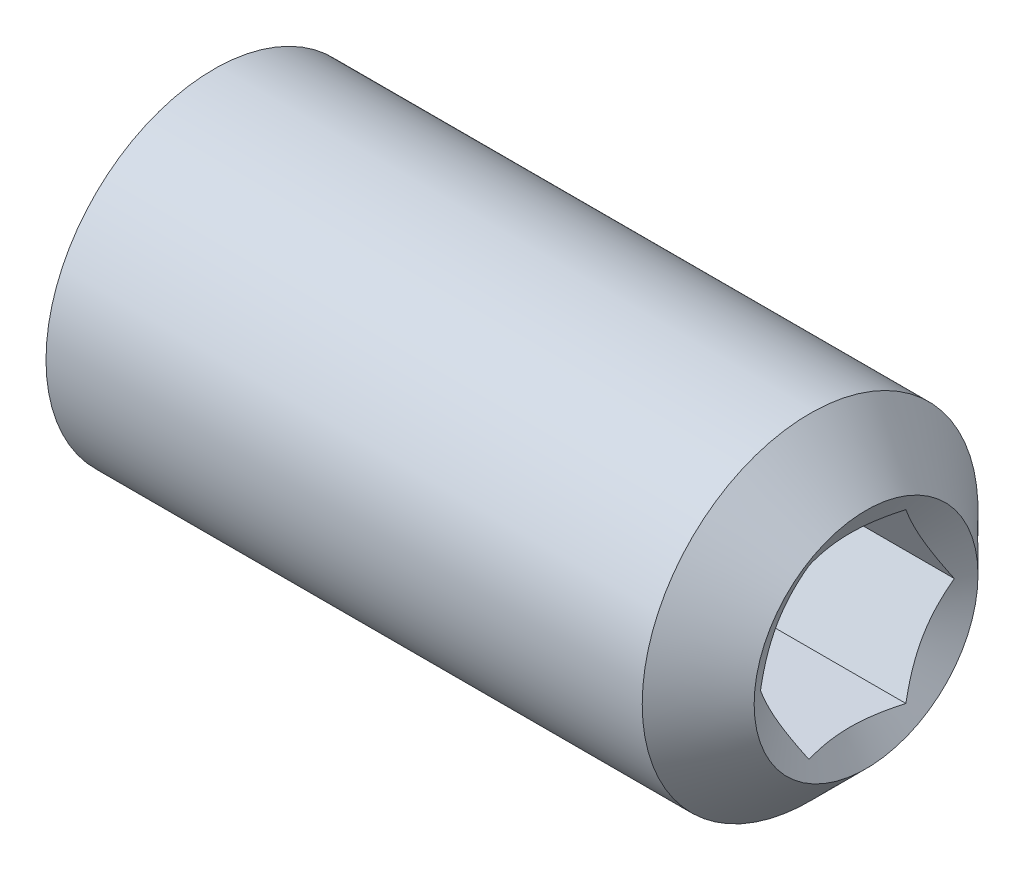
ISO-10303-21;
HEADER;
FILE_DESCRIPTION(('STEP AP214'),'2;1');
FILE_NAME('part.step','',(''),(''),'','','');
FILE_SCHEMA(('AUTOMOTIVE_DESIGN { 1 0 10303 214 1 1 1 1 }'));
ENDSEC;
DATA;
#1=APPLICATION_CONTEXT('core data for automotive mechanical design processes');
#2=APPLICATION_PROTOCOL_DEFINITION('international standard','automotive_design',2000,#1);
#3=PRODUCT_CONTEXT('',#1,'mechanical');
#4=PRODUCT('Part','Part','',(#3));
#5=PRODUCT_RELATED_PRODUCT_CATEGORY('part','',(#4));
#6=PRODUCT_DEFINITION_FORMATION('','',#4);
#7=PRODUCT_DEFINITION_CONTEXT('part definition',#1,'design');
#8=PRODUCT_DEFINITION('design','',#6,#7);
#9=PRODUCT_DEFINITION_SHAPE('','',#8);
#10=(LENGTH_UNIT() NAMED_UNIT(*) SI_UNIT(.MILLI.,.METRE.));
#11=(NAMED_UNIT(*) PLANE_ANGLE_UNIT() SI_UNIT($,.RADIAN.));
#12=(NAMED_UNIT(*) SI_UNIT($,.STERADIAN.) SOLID_ANGLE_UNIT());
#13=UNCERTAINTY_MEASURE_WITH_UNIT(LENGTH_MEASURE(1.E-05),#10,'distance_accuracy_value','');
#14=(GEOMETRIC_REPRESENTATION_CONTEXT(3) GLOBAL_UNCERTAINTY_ASSIGNED_CONTEXT((#13)) GLOBAL_UNIT_ASSIGNED_CONTEXT((#10,
#11,#12)) REPRESENTATION_CONTEXT('',''));
#15=CARTESIAN_POINT('',(0.,0.,0.));
#16=DIRECTION('',(0.,0.,1.));
#17=DIRECTION('',(1.,0.,0.));
#18=AXIS2_PLACEMENT_3D('',#15,#16,#17);
#19=CARTESIAN_POINT('',(0.,0.,0.));
#20=DIRECTION('',(-1.,0.,0.));
#21=DIRECTION('',(0.,0.,1.));
#22=AXIS2_PLACEMENT_3D('',#19,#20,#21);
#23=PLANE('',#22);
#24=CARTESIAN_POINT('',(0.,0.,0.));
#25=DIRECTION('',(-1.,0.,0.));
#26=DIRECTION('',(0.,0.,1.));
#27=AXIS2_PLACEMENT_3D('',#24,#25,#26);
#28=CIRCLE('',#27,2.4);
#29=CARTESIAN_POINT('',(0.,0.,2.4));
#30=VERTEX_POINT('',#29);
#31=EDGE_CURVE('E135',#30,#30,#28,.T.);
#32=ORIENTED_EDGE('',*,*,#31,.T.);
#33=EDGE_LOOP('',(#32));
#34=FACE_BOUND('',#33,.T.);
#35=DIRECTION('',(0.,0.,-1.));
#36=VECTOR('',#35,1.);
#37=CARTESIAN_POINT('',(0.,1.5,0.866025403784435));
#38=LINE('',#37,#36);
#39=CARTESIAN_POINT('',(0.,1.5,0.866025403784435));
#40=VERTEX_POINT('',#39);
#41=CARTESIAN_POINT('',(0.,1.5,-0.866025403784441));
#42=VERTEX_POINT('',#41);
#43=EDGE_CURVE('E108',#40,#42,#38,.T.);
#44=ORIENTED_EDGE('',*,*,#43,.F.);
#45=DIRECTION('',(0.,-0.866025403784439,0.5));
#46=VECTOR('',#45,1.);
#47=CARTESIAN_POINT('',(0.,1.5,0.866025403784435));
#48=LINE('',#47,#46);
#49=CARTESIAN_POINT('',(0.,0.,1.73205080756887));
#50=VERTEX_POINT('',#49);
#51=EDGE_CURVE('E52',#40,#50,#48,.T.);
#52=ORIENTED_EDGE('',*,*,#51,.T.);
#53=DIRECTION('',(0.,0.866025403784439,0.5));
#54=VECTOR('',#53,1.);
#55=CARTESIAN_POINT('',(0.,-1.5,0.866025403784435));
#56=LINE('',#55,#54);
#57=CARTESIAN_POINT('',(0.,-1.5,0.866025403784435));
#58=VERTEX_POINT('',#57);
#59=EDGE_CURVE('E98',#58,#50,#56,.T.);
#60=ORIENTED_EDGE('',*,*,#59,.F.);
#61=DIRECTION('',(0.,0.,-1.));
#62=VECTOR('',#61,1.);
#63=CARTESIAN_POINT('',(0.,-1.5,0.866025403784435));
#64=LINE('',#63,#62);
#65=CARTESIAN_POINT('',(0.,-1.5,-0.866025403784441));
#66=VERTEX_POINT('',#65);
#67=EDGE_CURVE('E104',#58,#66,#64,.T.);
#68=ORIENTED_EDGE('',*,*,#67,.T.);
#69=DIRECTION('',(0.,0.866025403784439,-0.5));
#70=VECTOR('',#69,1.);
#71=CARTESIAN_POINT('',(0.,-1.5,-0.866025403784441));
#72=LINE('',#71,#70);
#73=CARTESIAN_POINT('',(0.,0.,-1.73205080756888));
#74=VERTEX_POINT('',#73);
#75=EDGE_CURVE('E112',#66,#74,#72,.T.);
#76=ORIENTED_EDGE('',*,*,#75,.T.);
#77=DIRECTION('',(0.,-0.866025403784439,-0.5));
#78=VECTOR('',#77,1.);
#79=CARTESIAN_POINT('',(0.,1.5,-0.866025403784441));
#80=LINE('',#79,#78);
#81=EDGE_CURVE('E115',#42,#74,#80,.T.);
#82=ORIENTED_EDGE('',*,*,#81,.F.);
#83=EDGE_LOOP('',(#44,#52,#60,#68,#76,#82));
#84=FACE_BOUND('',#83,.T.);
#85=ADVANCED_FACE('F33',(#34,#84),#23,.T.);
#86=CARTESIAN_POINT('',(10.8452994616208,0.,0.));
#87=DIRECTION('',(1.,0.,0.));
#88=DIRECTION('',(0.,0.,-1.));
#89=AXIS2_PLACEMENT_3D('',#86,#87,#88);
#90=CONICAL_SURFACE('',#89,0.,1.0471975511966);
#91=CARTESIAN_POINT('',(12.,0.,0.));
#92=DIRECTION('',(-1.,0.,0.));
#93=DIRECTION('',(0.,0.,1.));
#94=AXIS2_PLACEMENT_3D('',#91,#92,#93);
#95=CIRCLE('',#94,2.);
#96=CARTESIAN_POINT('',(12.,0.,2.));
#97=VERTEX_POINT('',#96);
#98=EDGE_CURVE('E94',#97,#97,#95,.T.);
#99=ORIENTED_EDGE('',*,*,#98,.F.);
#100=EDGE_LOOP('',(#99));
#101=FACE_BOUND('',#100,.T.);
#102=CARTESIAN_POINT('',(11.8453661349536,1.5002,0.865909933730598));
#103=CARTESIAN_POINT('',(11.8233823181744,1.43428070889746,0.903968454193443));
#104=CARTESIAN_POINT('',(11.803388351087,1.36779241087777,0.942355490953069));
#105=CARTESIAN_POINT('',(11.7684875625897,1.23366433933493,1.01979436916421));
#106=CARTESIAN_POINT('',(11.7535930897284,1.16602218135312,1.05884758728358));
#107=CARTESIAN_POINT('',(11.7304061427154,1.03157622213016,1.13646999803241));
#108=CARTESIAN_POINT('',(11.721959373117,0.964793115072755,1.17502724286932));
#109=CARTESIAN_POINT('',(11.711873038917,0.830912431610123,1.25232329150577));
#110=CARTESIAN_POINT('',(11.7102251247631,0.763815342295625,1.29106181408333));
#111=CARTESIAN_POINT('',(11.7136410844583,0.638425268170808,1.363455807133));
#112=CARTESIAN_POINT('',(11.7178662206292,0.580113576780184,1.39712207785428));
#113=CARTESIAN_POINT('',(11.7312612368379,0.463870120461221,1.46423526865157));
#114=CARTESIAN_POINT('',(11.740435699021,0.405938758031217,1.49768195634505));
#115=CARTESIAN_POINT('',(11.7633726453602,0.289455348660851,1.56493368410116));
#116=CARTESIAN_POINT('',(11.7772324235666,0.230918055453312,1.59873020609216));
#117=CARTESIAN_POINT('',(11.8086892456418,0.114716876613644,1.6658189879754));
#118=CARTESIAN_POINT('',(11.8262788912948,0.0570515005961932,1.69911210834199));
#119=CARTESIAN_POINT('',(11.8453661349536,-0.000199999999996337,1.73216627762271));
#120=B_SPLINE_CURVE_WITH_KNOTS('',3,(#102,#103,#104,#105,#106,#107,#108,#109,#110,#111,#112,
#113,#114,#115,#116,#117,#118,#119),.UNSPECIFIED.,.F.,.F.,(4,2,2,2,2,2,2,2,4),(0.,
0.237777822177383,0.476127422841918,0.70857706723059,0.94074115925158,1.1429435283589,
1.34533342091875,1.55221450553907,1.75868901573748),.UNSPECIFIED.);
#121=CARTESIAN_POINT('',(11.8452994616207,1.5,0.866025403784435));
#122=VERTEX_POINT('',#121);
#123=CARTESIAN_POINT('',(11.8452994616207,0.,1.73205080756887));
#124=VERTEX_POINT('',#123);
#125=EDGE_CURVE('E11',#122,#124,#120,.T.);
#126=ORIENTED_EDGE('',*,*,#125,.F.);
#127=CARTESIAN_POINT('',(12.4201683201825,1.5,-2.27829668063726));
#128=CARTESIAN_POINT('',(12.3887590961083,1.5,-2.21314327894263));
#129=CARTESIAN_POINT('',(12.3576654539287,1.5,-2.14783511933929));
#130=CARTESIAN_POINT('',(12.2962877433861,1.5,-2.01682641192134));
#131=CARTESIAN_POINT('',(12.2660038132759,1.5,-1.95112579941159));
#132=CARTESIAN_POINT('',(12.2062612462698,1.5,-1.81888739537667));
#133=CARTESIAN_POINT('',(12.1768084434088,1.5,-1.75234695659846));
#134=CARTESIAN_POINT('',(12.1191756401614,1.5,-1.61872045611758));
#135=CARTESIAN_POINT('',(12.0909955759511,1.5,-1.55163442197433));
#136=CARTESIAN_POINT('',(12.0354632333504,1.5,-1.41488579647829));
#137=CARTESIAN_POINT('',(12.0081572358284,1.5,-1.34520416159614));
#138=CARTESIAN_POINT('',(11.955740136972,1.5,-1.20502279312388));
#139=CARTESIAN_POINT('',(11.9306293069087,1.5,-1.13452295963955));
#140=CARTESIAN_POINT('',(11.8596091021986,1.5,-0.921892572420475));
#141=CARTESIAN_POINT('',(11.8178535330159,1.5,-0.778257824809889));
#142=CARTESIAN_POINT('',(11.7689246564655,1.5,-0.560067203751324));
#143=CARTESIAN_POINT('',(11.7549158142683,1.5,-0.487052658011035));
#144=CARTESIAN_POINT('',(11.7323734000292,1.5,-0.340164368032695));
#145=CARTESIAN_POINT('',(11.7238393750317,1.5,-0.266290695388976));
#146=CARTESIAN_POINT('',(11.7130363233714,1.5,-0.118999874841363));
#147=CARTESIAN_POINT('',(11.7106905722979,1.5,-0.0455885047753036));
#148=CARTESIAN_POINT('',(11.7122563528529,1.5,0.101165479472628));
#149=CARTESIAN_POINT('',(11.71616820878,1.5,0.17450808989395));
#150=CARTESIAN_POINT('',(11.7329926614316,1.5,0.353360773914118));
#151=CARTESIAN_POINT('',(11.7491516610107,1.5,0.458566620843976));
#152=CARTESIAN_POINT('',(11.7913869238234,1.5,0.666968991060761));
#153=CARTESIAN_POINT('',(11.8174732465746,1.5,0.770163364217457));
#154=CARTESIAN_POINT('',(11.8774371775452,1.5,0.976776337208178));
#155=CARTESIAN_POINT('',(11.9114795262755,1.5,1.08014595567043));
#156=CARTESIAN_POINT('',(11.9663975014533,1.5,1.23376876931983));
#157=CARTESIAN_POINT('',(11.9853433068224,1.5,1.28473152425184));
#158=CARTESIAN_POINT('',(12.0243145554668,1.5,1.38624265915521));
#159=CARTESIAN_POINT('',(12.0443399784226,1.5,1.43679104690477));
#160=CARTESIAN_POINT('',(12.098134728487,1.5,1.56913564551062));
#161=CARTESIAN_POINT('',(12.132641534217,1.5,1.65063135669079));
#162=CARTESIAN_POINT('',(12.2034369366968,1.5,1.81284754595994));
#163=CARTESIAN_POINT('',(12.239725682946,1.5,1.89356795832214));
#164=CARTESIAN_POINT('',(12.3506237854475,1.5,2.13484537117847));
#165=CARTESIAN_POINT('',(12.4272466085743,1.5,2.2944747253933));
#166=CARTESIAN_POINT('',(12.5838318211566,1.5,2.61233200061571));
#167=CARTESIAN_POINT('',(12.6637985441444,1.5,2.77055775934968));
#168=CARTESIAN_POINT('',(12.8258358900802,1.5,3.08589273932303));
#169=CARTESIAN_POINT('',(12.9079061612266,1.5,3.24300214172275));
#170=CARTESIAN_POINT('',(13.0652617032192,1.5,3.54089305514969));
#171=CARTESIAN_POINT('',(13.1404113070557,1.5,3.6817464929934));
#172=CARTESIAN_POINT('',(13.2915707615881,1.5,3.96299957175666));
#173=CARTESIAN_POINT('',(13.3675806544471,1.5,4.10339918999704));
#174=CARTESIAN_POINT('',(13.5200274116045,1.5,4.38345606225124));
#175=CARTESIAN_POINT('',(13.5964624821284,1.5,4.52311429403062));
#176=CARTESIAN_POINT('',(13.7498269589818,1.5,4.80214740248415));
#177=CARTESIAN_POINT('',(13.82675633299,1.5,4.94152229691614));
#178=CARTESIAN_POINT('',(13.9038663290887,1.5,5.08079657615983));
#179=B_SPLINE_CURVE_WITH_KNOTS('',3,(#127,#128,#129,#130,#131,#132,#133,#134,#135,#136,#137,
#138,#139,#140,#141,#142,#143,#144,#145,#146,#147,#148,#149,#150,#151,#152,#153,#154,#155,#156,
#157,#158,#159,#160,#161,#162,#163,#164,#165,#166,#167,#168,#169,#170,#171,#172,#173,#174,#175,
#176,#177,#178),.UNSPECIFIED.,.F.,.F.,(4,2,2,2,2,2,2,2,2,2,2,2,2,2,2,2,2,2,2,2,2,2,2,2,2,4),(0.,
0.216990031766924,0.434016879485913,0.652307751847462,0.870587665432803,1.09507057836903,
1.3195811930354,1.76738754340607,1.9902617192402,2.21311745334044,2.43319686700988,
2.65328768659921,2.97194700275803,3.29093008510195,3.61721788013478,3.780321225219,
3.94342150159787,4.20889133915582,4.47438348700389,5.00551027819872,5.53734811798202,
6.06909758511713,6.54803514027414,7.02699627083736,7.50461499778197,7.98220280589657),.UNSPECIFIED.);
#180=CARTESIAN_POINT('',(11.8452994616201,1.5,-0.866025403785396));
#181=VERTEX_POINT('',#180);
#182=EDGE_CURVE('E138',#122,#181,#179,.F.);
#183=ORIENTED_EDGE('',*,*,#182,.T.);
#184=CARTESIAN_POINT('',(11.8453661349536,1.5002,-0.865909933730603));
#185=CARTESIAN_POINT('',(11.8233823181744,1.43428070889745,-0.903968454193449));
#186=CARTESIAN_POINT('',(11.803388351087,1.36779241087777,-0.942355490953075));
#187=CARTESIAN_POINT('',(11.7684875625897,1.23366433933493,-1.01979436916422));
#188=CARTESIAN_POINT('',(11.7535930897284,1.16602218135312,-1.05884758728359));
#189=CARTESIAN_POINT('',(11.7304061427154,1.03157622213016,-1.13646999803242));
#190=CARTESIAN_POINT('',(11.721959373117,0.964793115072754,-1.17502724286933));
#191=CARTESIAN_POINT('',(11.711873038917,0.830912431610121,-1.25232329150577));
#192=CARTESIAN_POINT('',(11.7102251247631,0.763815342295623,-1.29106181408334));
#193=CARTESIAN_POINT('',(11.7136410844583,0.638425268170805,-1.36345580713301));
#194=CARTESIAN_POINT('',(11.7178662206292,0.580113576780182,-1.39712207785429));
#195=CARTESIAN_POINT('',(11.7312612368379,0.463870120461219,-1.46423526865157));
#196=CARTESIAN_POINT('',(11.740435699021,0.405938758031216,-1.49768195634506));
#197=CARTESIAN_POINT('',(11.7633726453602,0.28945534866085,-1.56493368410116));
#198=CARTESIAN_POINT('',(11.7772324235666,0.23091805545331,-1.59873020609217));
#199=CARTESIAN_POINT('',(11.8086892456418,0.114716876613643,-1.6658189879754));
#200=CARTESIAN_POINT('',(11.8262788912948,0.0570515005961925,-1.699112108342));
#201=CARTESIAN_POINT('',(11.8453661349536,-0.000199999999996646,-1.73216627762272));
#202=B_SPLINE_CURVE_WITH_KNOTS('',3,(#184,#185,#186,#187,#188,#189,#190,#191,#192,#193,#194,
#195,#196,#197,#198,#199,#200,#201),.UNSPECIFIED.,.F.,.F.,(4,2,2,2,2,2,2,2,4),(0.,
0.237777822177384,0.47612742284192,0.708577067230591,0.940741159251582,1.14294352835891,
1.34533342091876,1.55221450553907,1.75868901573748),.UNSPECIFIED.);
#203=CARTESIAN_POINT('',(11.8452994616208,0.,-1.73205080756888));
#204=VERTEX_POINT('',#203);
#205=EDGE_CURVE('E145',#181,#204,#202,.T.);
#206=ORIENTED_EDGE('',*,*,#205,.T.);
#207=CARTESIAN_POINT('',(11.8453661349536,-1.5002,-0.865909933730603));
#208=CARTESIAN_POINT('',(11.8233823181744,-1.43428070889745,-0.903968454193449));
#209=CARTESIAN_POINT('',(11.803388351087,-1.36779241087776,-0.942355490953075));
#210=CARTESIAN_POINT('',(11.7684875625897,-1.23366433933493,-1.01979436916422));
#211=CARTESIAN_POINT('',(11.7535930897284,-1.16602218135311,-1.05884758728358));
#212=CARTESIAN_POINT('',(11.7304061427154,-1.03157622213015,-1.13646999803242));
#213=CARTESIAN_POINT('',(11.721959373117,-0.964793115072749,-1.17502724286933));
#214=CARTESIAN_POINT('',(11.711873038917,-0.830912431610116,-1.25232329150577));
#215=CARTESIAN_POINT('',(11.7102251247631,-0.763815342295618,-1.29106181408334));
#216=CARTESIAN_POINT('',(11.7136410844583,-0.638425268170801,-1.36345580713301));
#217=CARTESIAN_POINT('',(11.7178662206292,-0.580113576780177,-1.39712207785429));
#218=CARTESIAN_POINT('',(11.7312612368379,-0.463870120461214,-1.46423526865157));
#219=CARTESIAN_POINT('',(11.740435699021,-0.405938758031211,-1.49768195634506));
#220=CARTESIAN_POINT('',(11.7633726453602,-0.289455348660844,-1.56493368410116));
#221=CARTESIAN_POINT('',(11.7772324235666,-0.230918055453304,-1.59873020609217));
#222=CARTESIAN_POINT('',(11.8086892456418,-0.114716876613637,-1.6658189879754));
#223=CARTESIAN_POINT('',(11.8262788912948,-0.0570515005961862,-1.699112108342));
#224=CARTESIAN_POINT('',(11.8453661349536,0.000200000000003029,-1.73216627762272));
#225=B_SPLINE_CURVE_WITH_KNOTS('',3,(#207,#208,#209,#210,#211,#212,#213,#214,#215,#216,#217,
#218,#219,#220,#221,#222,#223,#224),.UNSPECIFIED.,.F.,.F.,(4,2,2,2,2,2,2,2,4),(0.,
0.237777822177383,0.476127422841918,0.708577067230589,0.940741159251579,1.1429435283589,
1.34533342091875,1.55221450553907,1.75868901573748),.UNSPECIFIED.);
#226=CARTESIAN_POINT('',(11.8452994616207,-1.5,-0.866025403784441));
#227=VERTEX_POINT('',#226);
#228=EDGE_CURVE('E168',#227,#204,#225,.T.);
#229=ORIENTED_EDGE('',*,*,#228,.F.);
#230=CARTESIAN_POINT('',(12.4201683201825,-1.5,-2.27829668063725));
#231=CARTESIAN_POINT('',(12.3887590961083,-1.5,-2.21314327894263));
#232=CARTESIAN_POINT('',(12.3576654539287,-1.5,-2.14783511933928));
#233=CARTESIAN_POINT('',(12.2962877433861,-1.5,-2.01682641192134));
#234=CARTESIAN_POINT('',(12.2660038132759,-1.5,-1.95112579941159));
#235=CARTESIAN_POINT('',(12.2062612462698,-1.5,-1.81888739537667));
#236=CARTESIAN_POINT('',(12.1768084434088,-1.5,-1.75234695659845));
#237=CARTESIAN_POINT('',(12.1191756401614,-1.5,-1.61872045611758));
#238=CARTESIAN_POINT('',(12.0909955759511,-1.5,-1.55163442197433));
#239=CARTESIAN_POINT('',(12.0354632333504,-1.5,-1.41488579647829));
#240=CARTESIAN_POINT('',(12.0081572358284,-1.5,-1.34520416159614));
#241=CARTESIAN_POINT('',(11.955740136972,-1.5,-1.20502279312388));
#242=CARTESIAN_POINT('',(11.9306293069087,-1.5,-1.13452295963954));
#243=CARTESIAN_POINT('',(11.8596091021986,-1.5,-0.921892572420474));
#244=CARTESIAN_POINT('',(11.8178535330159,-1.5,-0.778257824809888));
#245=CARTESIAN_POINT('',(11.7689246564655,-1.5,-0.560067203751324));
#246=CARTESIAN_POINT('',(11.7549158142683,-1.5,-0.487052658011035));
#247=CARTESIAN_POINT('',(11.7323734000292,-1.5,-0.340164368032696));
#248=CARTESIAN_POINT('',(11.7238393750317,-1.5,-0.266290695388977));
#249=CARTESIAN_POINT('',(11.7130363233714,-1.5,-0.118999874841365));
#250=CARTESIAN_POINT('',(11.7106905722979,-1.5,-0.0455885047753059));
#251=CARTESIAN_POINT('',(11.7122563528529,-1.5,0.101165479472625));
#252=CARTESIAN_POINT('',(11.71616820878,-1.5,0.174508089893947));
#253=CARTESIAN_POINT('',(11.7329926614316,-1.5,0.353360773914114));
#254=CARTESIAN_POINT('',(11.7491516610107,-1.5,0.458566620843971));
#255=CARTESIAN_POINT('',(11.7913869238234,-1.5,0.666968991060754));
#256=CARTESIAN_POINT('',(11.8174732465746,-1.5,0.77016336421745));
#257=CARTESIAN_POINT('',(11.8774371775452,-1.5,0.976776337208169));
#258=CARTESIAN_POINT('',(11.9114795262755,-1.5,1.08014595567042));
#259=CARTESIAN_POINT('',(11.9663975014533,-1.5,1.23376876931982));
#260=CARTESIAN_POINT('',(11.9853433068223,-1.5,1.28473152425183));
#261=CARTESIAN_POINT('',(12.0243145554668,-1.5,1.3862426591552));
#262=CARTESIAN_POINT('',(12.0443399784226,-1.5,1.43679104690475));
#263=CARTESIAN_POINT('',(12.098134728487,-1.5,1.56913564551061));
#264=CARTESIAN_POINT('',(12.132641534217,-1.5,1.65063135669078));
#265=CARTESIAN_POINT('',(12.2034369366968,-1.5,1.81284754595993));
#266=CARTESIAN_POINT('',(12.239725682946,-1.5,1.89356795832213));
#267=CARTESIAN_POINT('',(12.3506237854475,-1.5,2.13484537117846));
#268=CARTESIAN_POINT('',(12.4272466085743,-1.5,2.29447472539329));
#269=CARTESIAN_POINT('',(12.5838318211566,-1.5,2.6123320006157));
#270=CARTESIAN_POINT('',(12.6637985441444,-1.5,2.77055775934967));
#271=CARTESIAN_POINT('',(12.8258358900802,-1.5,3.08589273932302));
#272=CARTESIAN_POINT('',(12.9079061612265,-1.5,3.24300214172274));
#273=CARTESIAN_POINT('',(13.0652617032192,-1.5,3.54089305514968));
#274=CARTESIAN_POINT('',(13.1404113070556,-1.5,3.68174649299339));
#275=CARTESIAN_POINT('',(13.2915707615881,-1.5,3.96299957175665));
#276=CARTESIAN_POINT('',(13.3675806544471,-1.5,4.10339918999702));
#277=CARTESIAN_POINT('',(13.5200274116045,-1.5,4.38345606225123));
#278=CARTESIAN_POINT('',(13.5964624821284,-1.5,4.52311429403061));
#279=CARTESIAN_POINT('',(13.7498269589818,-1.5,4.80214740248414));
#280=CARTESIAN_POINT('',(13.82675633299,-1.5,4.94152229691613));
#281=CARTESIAN_POINT('',(13.9038663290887,-1.5,5.08079657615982));
#282=B_SPLINE_CURVE_WITH_KNOTS('',3,(#230,#231,#232,#233,#234,#235,#236,#237,#238,#239,#240,
#241,#242,#243,#244,#245,#246,#247,#248,#249,#250,#251,#252,#253,#254,#255,#256,#257,#258,#259,
#260,#261,#262,#263,#264,#265,#266,#267,#268,#269,#270,#271,#272,#273,#274,#275,#276,#277,#278,
#279,#280,#281),.UNSPECIFIED.,.F.,.F.,(4,2,2,2,2,2,2,2,2,2,2,2,2,2,2,2,2,2,2,2,2,2,2,2,2,4),(0.,
0.216990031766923,0.43401687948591,0.652307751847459,0.870587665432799,1.09507057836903,
1.31958119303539,1.76738754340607,1.9902617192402,2.21311745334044,2.43319686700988,
2.6532876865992,2.97194700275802,3.29093008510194,3.61721788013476,3.78032122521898,
3.94342150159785,4.2088913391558,4.47438348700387,5.00551027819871,5.53734811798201,
6.06909758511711,6.54803514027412,7.02699627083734,7.50461499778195,7.98220280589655),.UNSPECIFIED.);
#283=CARTESIAN_POINT('',(11.8452994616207,-1.5,0.866025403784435));
#284=VERTEX_POINT('',#283);
#285=EDGE_CURVE('E174',#284,#227,#282,.F.);
#286=ORIENTED_EDGE('',*,*,#285,.F.);
#287=CARTESIAN_POINT('',(11.8453661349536,-1.5002,0.865909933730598));
#288=CARTESIAN_POINT('',(11.8233823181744,-1.43428070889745,0.903968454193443));
#289=CARTESIAN_POINT('',(11.803388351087,-1.36779241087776,0.942355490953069));
#290=CARTESIAN_POINT('',(11.7684875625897,-1.23366433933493,1.01979436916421));
#291=CARTESIAN_POINT('',(11.7535930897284,-1.16602218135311,1.05884758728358));
#292=CARTESIAN_POINT('',(11.7304061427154,-1.03157622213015,1.13646999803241));
#293=CARTESIAN_POINT('',(11.721959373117,-0.96479311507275,1.17502724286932));
#294=CARTESIAN_POINT('',(11.711873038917,-0.830912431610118,1.25232329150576));
#295=CARTESIAN_POINT('',(11.7102251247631,-0.76381534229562,1.29106181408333));
#296=CARTESIAN_POINT('',(11.7136410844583,-0.638425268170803,1.363455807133));
#297=CARTESIAN_POINT('',(11.7178662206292,-0.580113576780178,1.39712207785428));
#298=CARTESIAN_POINT('',(11.7312612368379,-0.463870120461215,1.46423526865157));
#299=CARTESIAN_POINT('',(11.740435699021,-0.405938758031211,1.49768195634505));
#300=CARTESIAN_POINT('',(11.7633726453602,-0.289455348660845,1.56493368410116));
#301=CARTESIAN_POINT('',(11.7772324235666,-0.230918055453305,1.59873020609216));
#302=CARTESIAN_POINT('',(11.8086892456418,-0.114716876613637,1.6658189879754));
#303=CARTESIAN_POINT('',(11.8262788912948,-0.057051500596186,1.69911210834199));
#304=CARTESIAN_POINT('',(11.8453661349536,0.000200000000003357,1.73216627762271));
#305=B_SPLINE_CURVE_WITH_KNOTS('',3,(#287,#288,#289,#290,#291,#292,#293,#294,#295,#296,#297,
#298,#299,#300,#301,#302,#303,#304),.UNSPECIFIED.,.F.,.F.,(4,2,2,2,2,2,2,2,4),(0.,
0.237777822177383,0.476127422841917,0.708577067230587,0.940741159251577,1.1429435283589,
1.34533342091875,1.55221450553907,1.75868901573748),.UNSPECIFIED.);
#306=EDGE_CURVE('E45',#284,#124,#305,.T.);
#307=ORIENTED_EDGE('',*,*,#306,.T.);
#308=EDGE_LOOP('',(#126,#183,#206,#229,#286,#307));
#309=FACE_BOUND('',#308,.T.);
#310=ADVANCED_FACE('F153',(#101,#309),#90,.F.);
#311=CARTESIAN_POINT('',(0.,0.,0.));
#312=DIRECTION('',(1.,0.,0.));
#313=DIRECTION('',(0.,0.,-1.));
#314=AXIS2_PLACEMENT_3D('',#311,#312,#313);
#315=CONICAL_SURFACE('',#314,2.4,1.04719755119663);
#316=CARTESIAN_POINT('',(0.346410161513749,0.,0.));
#317=DIRECTION('',(-1.,0.,0.));
#318=DIRECTION('',(0.,0.,1.));
#319=AXIS2_PLACEMENT_3D('',#316,#317,#318);
#320=CIRCLE('',#319,3.);
#321=CARTESIAN_POINT('',(0.346410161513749,0.,3.));
#322=VERTEX_POINT('',#321);
#323=EDGE_CURVE('E132',#322,#322,#320,.T.);
#324=ORIENTED_EDGE('',*,*,#323,.T.);
#325=EDGE_LOOP('',(#324));
#326=FACE_BOUND('',#325,.T.);
#327=ORIENTED_EDGE('',*,*,#31,.F.);
#328=EDGE_LOOP('',(#327));
#329=FACE_BOUND('',#328,.T.);
#330=ADVANCED_FACE('F157',(#326,#329),#315,.T.);
#331=CARTESIAN_POINT('',(-12.7,0.,0.));
#332=DIRECTION('',(-1.,0.,0.));
#333=DIRECTION('',(0.,0.,1.));
#334=AXIS2_PLACEMENT_3D('',#331,#332,#333);
#335=CYLINDRICAL_SURFACE('',#334,3.);
#336=CARTESIAN_POINT('',(11.,0.,0.));
#337=DIRECTION('',(-1.,0.,0.));
#338=DIRECTION('',(0.,0.,1.));
#339=AXIS2_PLACEMENT_3D('',#336,#337,#338);
#340=CIRCLE('',#339,3.);
#341=CARTESIAN_POINT('',(11.,0.,3.));
#342=VERTEX_POINT('',#341);
#343=EDGE_CURVE('E129',#342,#342,#340,.T.);
#344=ORIENTED_EDGE('',*,*,#343,.T.);
#345=EDGE_LOOP('',(#344));
#346=FACE_BOUND('',#345,.T.);
#347=ORIENTED_EDGE('',*,*,#323,.F.);
#348=EDGE_LOOP('',(#347));
#349=FACE_BOUND('',#348,.T.);
#350=ADVANCED_FACE('F206',(#346,#349),#335,.T.);
#351=CARTESIAN_POINT('',(11.,0.,0.));
#352=DIRECTION('',(-1.,0.,0.));
#353=DIRECTION('',(0.,0.,1.));
#354=AXIS2_PLACEMENT_3D('',#351,#352,#353);
#355=CONICAL_SURFACE('',#354,3.,0.785398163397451);
#356=ORIENTED_EDGE('',*,*,#98,.T.);
#357=EDGE_LOOP('',(#356));
#358=FACE_BOUND('',#357,.T.);
#359=ORIENTED_EDGE('',*,*,#343,.F.);
#360=EDGE_LOOP('',(#359));
#361=FACE_BOUND('',#360,.T.);
#362=ADVANCED_FACE('F161',(#358,#361),#355,.T.);
#363=CARTESIAN_POINT('',(12.,1.5,0.866025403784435));
#364=DIRECTION('',(0.,-0.5,-0.866025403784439));
#365=DIRECTION('',(0.,0.866025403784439,-0.5));
#366=AXIS2_PLACEMENT_3D('',#363,#364,#365);
#367=PLANE('',#366);
#368=ORIENTED_EDGE('',*,*,#125,.T.);
#369=DIRECTION('',(-1.,0.,0.));
#370=VECTOR('',#369,1.);
#371=CARTESIAN_POINT('',(12.,0.,1.73205080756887));
#372=LINE('',#371,#370);
#373=EDGE_CURVE('E88',#124,#50,#372,.T.);
#374=ORIENTED_EDGE('',*,*,#373,.T.);
#375=ORIENTED_EDGE('',*,*,#51,.F.);
#376=DIRECTION('',(-1.,0.,0.));
#377=VECTOR('',#376,1.);
#378=CARTESIAN_POINT('',(12.,1.5,0.866025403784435));
#379=LINE('',#378,#377);
#380=EDGE_CURVE('E119',#122,#40,#379,.T.);
#381=ORIENTED_EDGE('',*,*,#380,.F.);
#382=EDGE_LOOP('',(#368,#374,#375,#381));
#383=FACE_BOUND('',#382,.T.);
#384=ADVANCED_FACE('F90',(#383),#367,.T.);
#385=CARTESIAN_POINT('',(12.,-1.5,0.866025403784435));
#386=DIRECTION('',(0.,-0.5,0.866025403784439));
#387=DIRECTION('',(0.,-0.866025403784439,-0.5));
#388=AXIS2_PLACEMENT_3D('',#385,#386,#387);
#389=PLANE('',#388);
#390=DIRECTION('',(-1.,0.,0.));
#391=VECTOR('',#390,1.);
#392=CARTESIAN_POINT('',(12.,-1.5,0.866025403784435));
#393=LINE('',#392,#391);
#394=EDGE_CURVE('E95',#284,#58,#393,.T.);
#395=ORIENTED_EDGE('',*,*,#394,.T.);
#396=ORIENTED_EDGE('',*,*,#59,.T.);
#397=ORIENTED_EDGE('',*,*,#373,.F.);
#398=ORIENTED_EDGE('',*,*,#306,.F.);
#399=EDGE_LOOP('',(#395,#396,#397,#398));
#400=FACE_BOUND('',#399,.T.);
#401=ADVANCED_FACE('F99',(#400),#389,.F.);
#402=CARTESIAN_POINT('',(12.,-1.5,0.866025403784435));
#403=DIRECTION('',(0.,1.,0.));
#404=DIRECTION('',(0.,0.,1.));
#405=AXIS2_PLACEMENT_3D('',#402,#403,#404);
#406=PLANE('',#405);
#407=ORIENTED_EDGE('',*,*,#285,.T.);
#408=DIRECTION('',(-1.,0.,0.));
#409=VECTOR('',#408,1.);
#410=CARTESIAN_POINT('',(12.,-1.5,-0.866025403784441));
#411=LINE('',#410,#409);
#412=EDGE_CURVE('E124',#227,#66,#411,.T.);
#413=ORIENTED_EDGE('',*,*,#412,.T.);
#414=ORIENTED_EDGE('',*,*,#67,.F.);
#415=ORIENTED_EDGE('',*,*,#394,.F.);
#416=EDGE_LOOP('',(#407,#413,#414,#415));
#417=FACE_BOUND('',#416,.T.);
#418=ADVANCED_FACE('F184',(#417),#406,.T.);
#419=CARTESIAN_POINT('',(12.,-1.5,-0.866025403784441));
#420=DIRECTION('',(0.,0.5,0.866025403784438));
#421=DIRECTION('',(0.,-0.866025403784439,0.5));
#422=AXIS2_PLACEMENT_3D('',#419,#420,#421);
#423=PLANE('',#422);
#424=ORIENTED_EDGE('',*,*,#228,.T.);
#425=DIRECTION('',(-1.,0.,0.));
#426=VECTOR('',#425,1.);
#427=CARTESIAN_POINT('',(12.,0.,-1.73205080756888));
#428=LINE('',#427,#426);
#429=EDGE_CURVE('E122',#204,#74,#428,.T.);
#430=ORIENTED_EDGE('',*,*,#429,.T.);
#431=ORIENTED_EDGE('',*,*,#75,.F.);
#432=ORIENTED_EDGE('',*,*,#412,.F.);
#433=EDGE_LOOP('',(#424,#430,#431,#432));
#434=FACE_BOUND('',#433,.T.);
#435=ADVANCED_FACE('F187',(#434),#423,.T.);
#436=CARTESIAN_POINT('',(12.,1.5,-0.866025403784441));
#437=DIRECTION('',(0.,0.5,-0.866025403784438));
#438=DIRECTION('',(0.,0.866025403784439,0.5));
#439=AXIS2_PLACEMENT_3D('',#436,#437,#438);
#440=PLANE('',#439);
#441=DIRECTION('',(-1.,0.,0.));
#442=VECTOR('',#441,1.);
#443=CARTESIAN_POINT('',(12.,1.5,-0.866025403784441));
#444=LINE('',#443,#442);
#445=EDGE_CURVE('E60',#181,#42,#444,.T.);
#446=ORIENTED_EDGE('',*,*,#445,.T.);
#447=ORIENTED_EDGE('',*,*,#81,.T.);
#448=ORIENTED_EDGE('',*,*,#429,.F.);
#449=ORIENTED_EDGE('',*,*,#205,.F.);
#450=EDGE_LOOP('',(#446,#447,#448,#449));
#451=FACE_BOUND('',#450,.T.);
#452=ADVANCED_FACE('F191',(#451),#440,.F.);
#453=CARTESIAN_POINT('',(12.,1.5,0.866025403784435));
#454=DIRECTION('',(0.,1.,0.));
#455=DIRECTION('',(0.,0.,1.));
#456=AXIS2_PLACEMENT_3D('',#453,#454,#455);
#457=PLANE('',#456);
#458=ORIENTED_EDGE('',*,*,#380,.T.);
#459=ORIENTED_EDGE('',*,*,#43,.T.);
#460=ORIENTED_EDGE('',*,*,#445,.F.);
#461=ORIENTED_EDGE('',*,*,#182,.F.);
#462=EDGE_LOOP('',(#458,#459,#460,#461));
#463=FACE_BOUND('',#462,.T.);
#464=ADVANCED_FACE('F151',(#463),#457,.F.);
#465=CLOSED_SHELL('',(#85,#310,#330,#350,#362,#384,#401,#418,#435,#452,#464));
#466=MANIFOLD_SOLID_BREP('B2',#465);
#467=ADVANCED_BREP_SHAPE_REPRESENTATION('',(#18,#466),#14);
#468=SHAPE_DEFINITION_REPRESENTATION(#9,#467);
ENDSEC;
END-ISO-10303-21;
